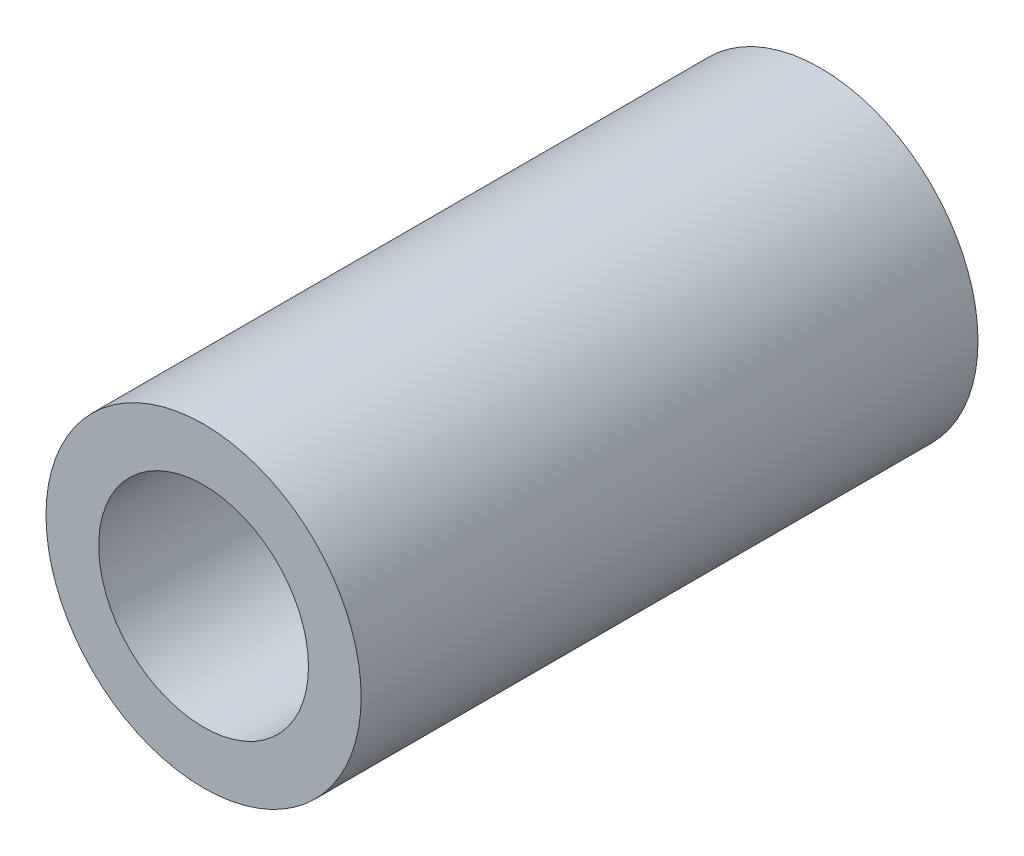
ISO-10303-21;
HEADER;
FILE_DESCRIPTION(('STEP AP214'),'2;1');
FILE_NAME('part.step','',(''),(''),'','','');
FILE_SCHEMA(('AUTOMOTIVE_DESIGN { 1 0 10303 214 1 1 1 1 }'));
ENDSEC;
DATA;
#1=APPLICATION_CONTEXT('core data for automotive mechanical design processes');
#2=APPLICATION_PROTOCOL_DEFINITION('international standard','automotive_design',2000,#1);
#3=PRODUCT_CONTEXT('',#1,'mechanical');
#4=PRODUCT('Part','Part','',(#3));
#5=PRODUCT_RELATED_PRODUCT_CATEGORY('part','',(#4));
#6=PRODUCT_DEFINITION_FORMATION('','',#4);
#7=PRODUCT_DEFINITION_CONTEXT('part definition',#1,'design');
#8=PRODUCT_DEFINITION('design','',#6,#7);
#9=PRODUCT_DEFINITION_SHAPE('','',#8);
#10=(LENGTH_UNIT() NAMED_UNIT(*) SI_UNIT(.MILLI.,.METRE.));
#11=(NAMED_UNIT(*) PLANE_ANGLE_UNIT() SI_UNIT($,.RADIAN.));
#12=(NAMED_UNIT(*) SI_UNIT($,.STERADIAN.) SOLID_ANGLE_UNIT());
#13=UNCERTAINTY_MEASURE_WITH_UNIT(LENGTH_MEASURE(1.E-05),#10,'distance_accuracy_value','');
#14=(GEOMETRIC_REPRESENTATION_CONTEXT(3) GLOBAL_UNCERTAINTY_ASSIGNED_CONTEXT((#13)) GLOBAL_UNIT_ASSIGNED_CONTEXT((#10,
#11,#12)) REPRESENTATION_CONTEXT('',''));
#15=CARTESIAN_POINT('',(0.,0.,0.));
#16=DIRECTION('',(0.,0.,1.));
#17=DIRECTION('',(1.,0.,0.));
#18=AXIS2_PLACEMENT_3D('',#15,#16,#17);
#19=CARTESIAN_POINT('',(0.,0.,8.7376));
#20=DIRECTION('',(0.,0.,1.));
#21=DIRECTION('',(1.,0.,0.));
#22=AXIS2_PLACEMENT_3D('',#19,#20,#21);
#23=PLANE('',#22);
#24=CARTESIAN_POINT('',(0.,0.,8.7376));
#25=DIRECTION('',(0.,0.,1.));
#26=DIRECTION('',(1.,0.,0.));
#27=AXIS2_PLACEMENT_3D('',#24,#25,#26);
#28=CIRCLE('',#27,4.46405);
#29=CARTESIAN_POINT('',(4.46405,0.,8.7376));
#30=VERTEX_POINT('',#29);
#31=EDGE_CURVE('E10',#30,#30,#28,.T.);
#32=ORIENTED_EDGE('',*,*,#31,.T.);
#33=EDGE_LOOP('',(#32));
#34=FACE_BOUND('',#33,.T.);
#35=CARTESIAN_POINT('',(0.,0.,8.7376));
#36=DIRECTION('',(0.,0.,1.));
#37=DIRECTION('',(1.,0.,0.));
#38=AXIS2_PLACEMENT_3D('',#35,#36,#37);
#39=CIRCLE('',#38,2.9718);
#40=CARTESIAN_POINT('',(2.9718,0.,8.7376));
#41=VERTEX_POINT('',#40);
#42=EDGE_CURVE('E45',#41,#41,#39,.T.);
#43=ORIENTED_EDGE('',*,*,#42,.F.);
#44=EDGE_LOOP('',(#43));
#45=FACE_BOUND('',#44,.T.);
#46=ADVANCED_FACE('F34',(#34,#45),#23,.T.);
#47=CARTESIAN_POINT('',(0.,0.,-8.7376));
#48=DIRECTION('',(0.,0.,1.));
#49=DIRECTION('',(1.,0.,0.));
#50=AXIS2_PLACEMENT_3D('',#47,#48,#49);
#51=PLANE('',#50);
#52=CARTESIAN_POINT('',(0.,0.,-8.7376));
#53=DIRECTION('',(0.,0.,1.));
#54=DIRECTION('',(1.,0.,0.));
#55=AXIS2_PLACEMENT_3D('',#52,#53,#54);
#56=CIRCLE('',#55,4.46405);
#57=CARTESIAN_POINT('',(4.46405,0.,-8.7376));
#58=VERTEX_POINT('',#57);
#59=EDGE_CURVE('E38',#58,#58,#56,.T.);
#60=ORIENTED_EDGE('',*,*,#59,.F.);
#61=EDGE_LOOP('',(#60));
#62=FACE_BOUND('',#61,.T.);
#63=CARTESIAN_POINT('',(0.,0.,-8.7376));
#64=DIRECTION('',(0.,0.,1.));
#65=DIRECTION('',(1.,0.,0.));
#66=AXIS2_PLACEMENT_3D('',#63,#64,#65);
#67=CIRCLE('',#66,2.9718);
#68=CARTESIAN_POINT('',(2.9718,0.,-8.7376));
#69=VERTEX_POINT('',#68);
#70=EDGE_CURVE('E47',#69,#69,#67,.T.);
#71=ORIENTED_EDGE('',*,*,#70,.T.);
#72=EDGE_LOOP('',(#71));
#73=FACE_BOUND('',#72,.T.);
#74=ADVANCED_FACE('F57',(#62,#73),#51,.F.);
#75=CARTESIAN_POINT('',(0.,0.,8.7376));
#76=DIRECTION('',(0.,0.,-1.));
#77=DIRECTION('',(-1.,0.,0.));
#78=AXIS2_PLACEMENT_3D('',#75,#76,#77);
#79=CYLINDRICAL_SURFACE('',#78,4.46405);
#80=ORIENTED_EDGE('',*,*,#31,.F.);
#81=EDGE_LOOP('',(#80));
#82=FACE_BOUND('',#81,.T.);
#83=ORIENTED_EDGE('',*,*,#59,.T.);
#84=EDGE_LOOP('',(#83));
#85=FACE_BOUND('',#84,.T.);
#86=ADVANCED_FACE('F36',(#82,#85),#79,.T.);
#87=CARTESIAN_POINT('',(0.,0.,8.7376));
#88=DIRECTION('',(0.,0.,-1.));
#89=DIRECTION('',(-1.,0.,0.));
#90=AXIS2_PLACEMENT_3D('',#87,#88,#89);
#91=CYLINDRICAL_SURFACE('',#90,2.9718);
#92=ORIENTED_EDGE('',*,*,#42,.T.);
#93=EDGE_LOOP('',(#92));
#94=FACE_BOUND('',#93,.T.);
#95=ORIENTED_EDGE('',*,*,#70,.F.);
#96=EDGE_LOOP('',(#95));
#97=FACE_BOUND('',#96,.T.);
#98=ADVANCED_FACE('F53',(#94,#97),#91,.F.);
#99=CLOSED_SHELL('',(#46,#74,#86,#98));
#100=MANIFOLD_SOLID_BREP('B2',#99);
#101=ADVANCED_BREP_SHAPE_REPRESENTATION('',(#18,#100),#14);
#102=SHAPE_DEFINITION_REPRESENTATION(#9,#101);
ENDSEC;
END-ISO-10303-21;
